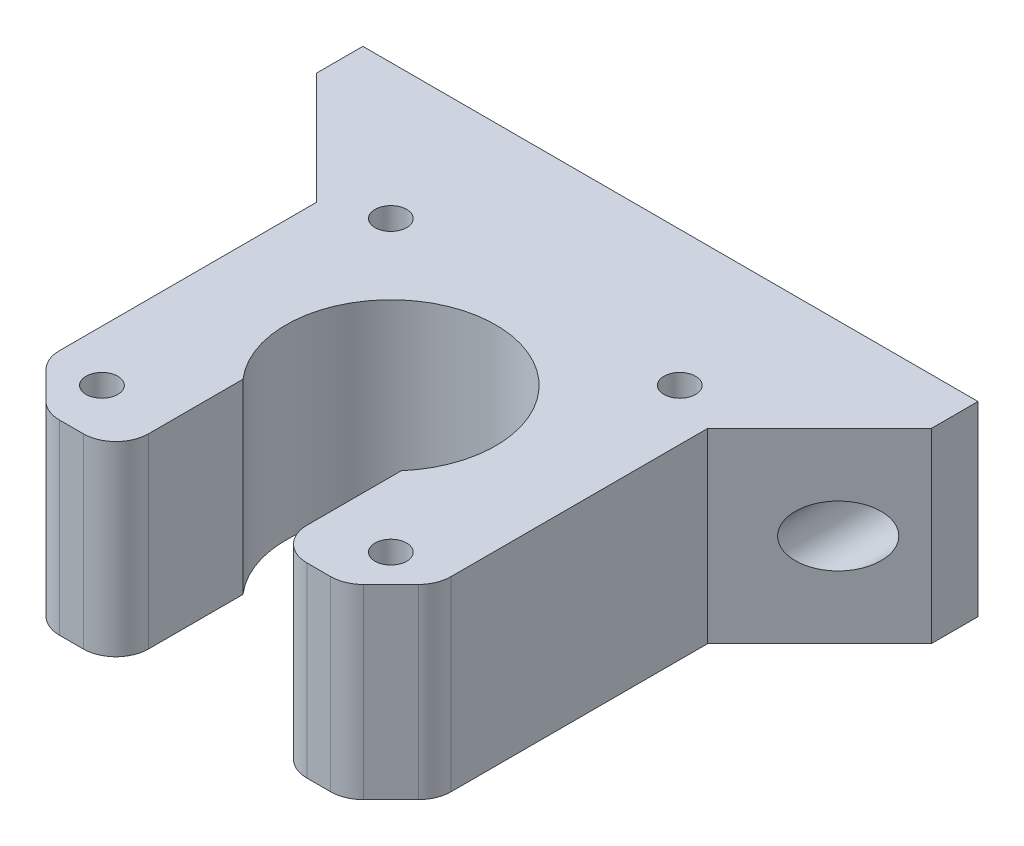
from build123d import *

# Parameters (mm, degrees)
SKIZZE1_W                                            = 42
SKIZZE1_H                                            = 42
AUFSATZ_LINEAR_AUSTRAGEN1_DEPTH                      = 10
SCHNITT_LINEAR_AUSTRAGEN1_DEPTH                      = 36.80502758
STIRNSENKUNG_F_R_M3_ZYLINDERSCHRAUBE_MIT_D           = 3.4
STIRNSENKUNG_F_R_M3_ZYLINDERSCHRAUBE_MIT_CBORE_D     = 6.5
STIRNSENKUNG_F_R_M3_ZYLINDERSCHRAUBE_MIT_CBORE_DEPTH = 3.4
SKIZZE5_W                                            = 42
SKIZZE5_H                                            = 20
AUFSATZ_LINEAR_AUSTRAGEN2_DEPTH                      = 9
SKIZZE7_W                                            = 42
SKIZZE7_H                                            = 4.8
AUFSATZ_LINEAR_AUSTRAGEN3_DEPTH                      = 3
FASE1_SIZE                                           = 5
VERRUNDUNG1_R                                        = 3.5
AUFSATZ_LINEAR_AUSTRAGEN4_DEPTH                      = 20
STIRNSENKUNG_F_R_M3_ZYLINDERSCHRAUBE_2_A_COUNT       = 2
STIRNSENKUNG_F_R_M3_ZYLINDERSCHRAUBE_2_A_PITCH       = 56
SKIZZE13_R                                           = 3.25
SCHNITT_LINEAR_AUSTRAGEN2_DEPTH                      = 58.489129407
SKIZZE14_W                                           = 3
SKIZZE14_H                                           = 4.8
SCHNITT_LINEAR_AUSTRAGEN3_DEPTH                      = 3


with BuildPart() as part:
    # Skizze1 → Aufsatz-Linear austragen1 (new, symmetric)
    with BuildSketch(Plane(origin=(0, 0, 0), x_dir=(1, 0, 0), z_dir=(0, 1, 0))):
        Rectangle(SKIZZE1_W, SKIZZE1_H)
    extrude(amount=AUFSATZ_LINEAR_AUSTRAGEN1_DEPTH, both=True)

    # Skizze2 → Schnitt-Linear austragen1 (cut, through all)
    with BuildSketch(Plane(origin=(0, 10, 0), x_dir=(1, 0, 0), z_dir=(0, 1, 0))):
        with BuildLine():
            Line((-8.5, -21), (8.5, -21))
            Line((8.5, -21), (8.5, -7.369701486))
            ThreePointArc((8.5, -7.369701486), (0, 11.25), (-8.5, -7.369701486))
            Line((-8.5, -7.369701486), (-8.5, -21))
        make_face()
    extrude(amount=-SCHNITT_LINEAR_AUSTRAGEN1_DEPTH, mode=Mode.SUBTRACT)

    # Stirnsenkung f_r M3 Zylinderschraube mit (through all)
    with Locations(Plane(origin=(0, -10, 0), x_dir=(-1, 0, 0), z_dir=(0, -1, 0))):
        with Locations((15.5, -15.5), (15.5, 15.5), (-15.5, 15.5), (-15.5, -15.5)):
            CounterBoreHole(STIRNSENKUNG_F_R_M3_ZYLINDERSCHRAUBE_MIT_D / 2, STIRNSENKUNG_F_R_M3_ZYLINDERSCHRAUBE_MIT_CBORE_D / 2, STIRNSENKUNG_F_R_M3_ZYLINDERSCHRAUBE_MIT_CBORE_DEPTH)

    # Skizze5 → Aufsatz-Linear austragen2 (add)
    with BuildSketch(Plane(origin=(0, 0, -21), x_dir=(-1, 0, 0), z_dir=(0, 0, -1))):
        Rectangle(SKIZZE5_W, SKIZZE5_H)
    extrude(amount=AUFSATZ_LINEAR_AUSTRAGEN2_DEPTH)

    # Skizze7 → Aufsatz-Linear austragen3 (add)
    with BuildSketch(Plane(origin=(0, 0, -30), x_dir=(-1, 0, 0), z_dir=(0, 0, -1))):
        Rectangle(SKIZZE7_W, SKIZZE7_H)
    extrude(amount=AUFSATZ_LINEAR_AUSTRAGEN3_DEPTH)

    # Fase1
    fase1_edges = [part.edges().sort_by_distance(p)[0] for p in [
        (21, 0, 21),
        (-21, 0, 21),
    ]]
    chamfer(fase1_edges, length=FASE1_SIZE)

    # Verrundung1
    verrundung1_edges = [part.edges().sort_by_distance(p)[0] for p in [
        (-8.5, 0, 21),
        (8.5, 0, 21),
        (-16, 0, 21),
        (-21, 0, 16),
        (21, 0, 16),
        (16, 0, 21),
    ]]
    fillet(verrundung1_edges, radius=VERRUNDUNG1_R)

    # Skizze8 → Aufsatz-Linear austragen4 (add)
    with BuildSketch(Plane(origin=(0, 10, 0), x_dir=(1, 0, 0), z_dir=(0, 1, 0))):
        Polygon((-21, 30), (-33, 30), (-33, 25), (-21, 13), align=None)
        Polygon((21, 30), (33, 30), (33, 25), (21, 13), align=None)
    extrude(amount=-AUFSATZ_LINEAR_AUSTRAGEN4_DEPTH)

    # Skizze12 → Stirnsenkung f_r M3 Zylinderschraube 2 (revolve, cut)
    with BuildSketch(Plane(origin=(-28, 0, -25), x_dir=(0, -1, 0), z_dir=(1, 0, 0))):
        Polygon((0, 0), (0, 8), (1.7, 8), (1.7, 3.4), (3.25, 3.4), (3.25, 0), align=None)
    stirnsenkung_f_r_m3_zylinderschraube_2 = revolve(axis=Axis((-28, 0, -18.65), (0, 0, -1)), mode=Mode.SUBTRACT)

    # Stirnsenkung f_r M3 Zylinderschraube 2 a: Stirnsenkung f_r M3 Zylinderschraube 2 ×2
    with Locations(*[(i * STIRNSENKUNG_F_R_M3_ZYLINDERSCHRAUBE_2_A_PITCH, 0, 0) for i in range(1, STIRNSENKUNG_F_R_M3_ZYLINDERSCHRAUBE_2_A_COUNT)]):
        add(stirnsenkung_f_r_m3_zylinderschraube_2, mode=Mode.SUBTRACT)

    # Skizze13 → Schnitt-Linear austragen2 (cut, through all)
    with BuildSketch(Plane(origin=(0, 0, -25), x_dir=(-1, 0, 0), z_dir=(0, 0, -1))):
        with Locations(Location((-28, 0, 0), (0, 0, 180))):
            Circle(SKIZZE13_R)
        with Locations(Location((28, 0, 0), (0, 0, 180))):
            Circle(SKIZZE13_R)
    extrude(amount=-SCHNITT_LINEAR_AUSTRAGEN2_DEPTH, mode=Mode.SUBTRACT)

    # Skizze14 → Schnitt-Linear austragen3 (cut)
    with BuildSketch(Plane(origin=(0, 0, -33), x_dir=(-1, 0, 0), z_dir=(0, 0, -1))):
        with Locations((-19.5, 0)):
            Rectangle(SKIZZE14_W, SKIZZE14_H)
        with Locations((19.5, 0)):
            Rectangle(SKIZZE14_W, SKIZZE14_H)
    extrude(amount=-SCHNITT_LINEAR_AUSTRAGEN3_DEPTH, mode=Mode.SUBTRACT)


solid = part.part
